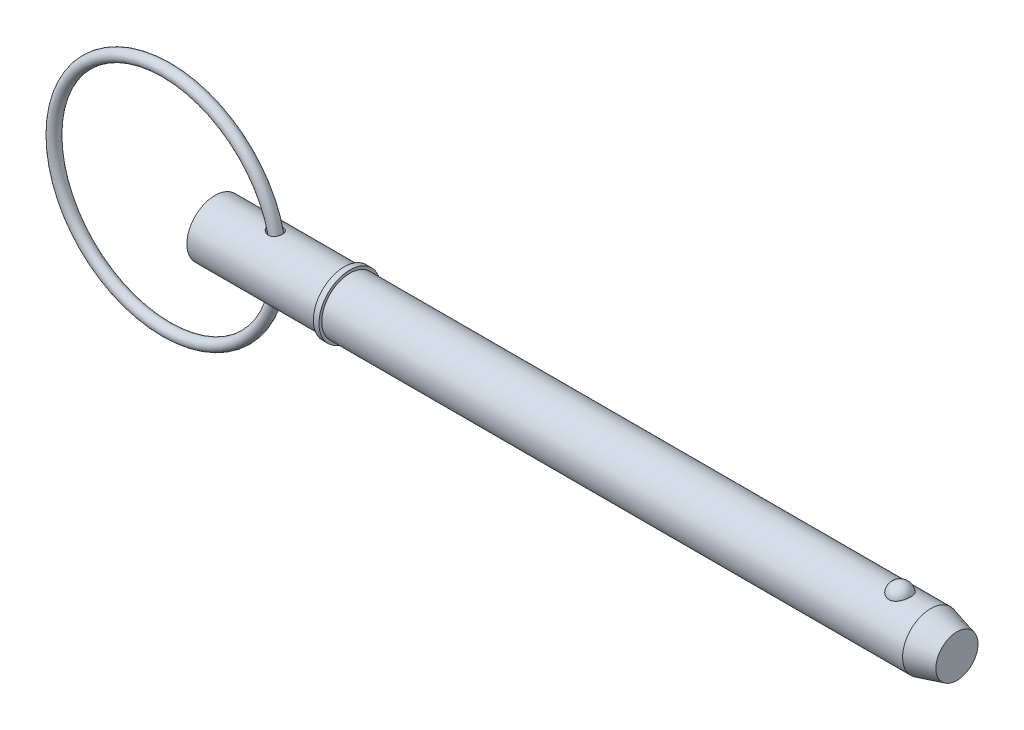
ISO-10303-21;
HEADER;
FILE_DESCRIPTION(('STEP AP214'),'2;1');
FILE_NAME('part.step','',(''),(''),'','','');
FILE_SCHEMA(('AUTOMOTIVE_DESIGN { 1 0 10303 214 1 1 1 1 }'));
ENDSEC;
DATA;
#1=APPLICATION_CONTEXT('core data for automotive mechanical design processes');
#2=APPLICATION_PROTOCOL_DEFINITION('international standard','automotive_design',2000,#1);
#3=PRODUCT_CONTEXT('',#1,'mechanical');
#4=PRODUCT('Part','Part','',(#3));
#5=PRODUCT_RELATED_PRODUCT_CATEGORY('part','',(#4));
#6=PRODUCT_DEFINITION_FORMATION('','',#4);
#7=PRODUCT_DEFINITION_CONTEXT('part definition',#1,'design');
#8=PRODUCT_DEFINITION('design','',#6,#7);
#9=PRODUCT_DEFINITION_SHAPE('','',#8);
#10=(LENGTH_UNIT() NAMED_UNIT(*) SI_UNIT(.MILLI.,.METRE.));
#11=(NAMED_UNIT(*) PLANE_ANGLE_UNIT() SI_UNIT($,.RADIAN.));
#12=(NAMED_UNIT(*) SI_UNIT($,.STERADIAN.) SOLID_ANGLE_UNIT());
#13=UNCERTAINTY_MEASURE_WITH_UNIT(LENGTH_MEASURE(1.E-05),#10,'distance_accuracy_value','');
#14=(GEOMETRIC_REPRESENTATION_CONTEXT(3) GLOBAL_UNCERTAINTY_ASSIGNED_CONTEXT((#13)) GLOBAL_UNIT_ASSIGNED_CONTEXT((#10,
#11,#12)) REPRESENTATION_CONTEXT('',''));
#15=CARTESIAN_POINT('',(0.,0.,0.));
#16=DIRECTION('',(0.,0.,1.));
#17=DIRECTION('',(1.,0.,0.));
#18=AXIS2_PLACEMENT_3D('',#15,#16,#17);
#19=CARTESIAN_POINT('',(-6.86864682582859,0.,0.));
#20=DIRECTION('',(0.,0.,1.));
#21=DIRECTION('',(1.,0.,0.));
#22=AXIS2_PLACEMENT_3D('',#19,#20,#21);
#23=TOROIDAL_SURFACE('',#22,15.875,0.794);
#24=CARTESIAN_POINT('',(9.80035317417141,0.,0.));
#25=VERTEX_POINT('',#24);
#26=VERTEX_LOOP('',#25);
#27=FACE_BOUND('',#26,.T.);
#28=ADVANCED_FACE('P0_F12',(#27),#23,.T.);
#29=CLOSED_SHELL('',(#28));
#30=MANIFOLD_SOLID_BREP('P0_B1',#29);
#31=CARTESIAN_POINT('',(0.,0.,0.));
#32=DIRECTION('',(1.,0.,0.));
#33=DIRECTION('',(0.,0.,-1.));
#34=AXIS2_PLACEMENT_3D('',#31,#32,#33);
#35=CYLINDRICAL_SURFACE('',#34,3.97);
#36=CARTESIAN_POINT('',(7.49679817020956,3.96502331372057,-0.198721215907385));
#37=CARTESIAN_POINT('',(7.50881508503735,3.96235594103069,-0.251916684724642));
#38=CARTESIAN_POINT('',(7.52561550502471,3.95866151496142,-0.304017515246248));
#39=CARTESIAN_POINT('',(7.56786984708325,3.9496659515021,-0.40447153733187));
#40=CARTESIAN_POINT('',(7.59333797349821,3.94436217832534,-0.452818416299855));
#41=CARTESIAN_POINT('',(7.65162192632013,3.93277091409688,-0.544364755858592));
#42=CARTESIAN_POINT('',(7.68440149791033,3.92648832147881,-0.587588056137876));
#43=CARTESIAN_POINT('',(7.75622109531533,3.91354812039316,-0.668369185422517));
#44=CARTESIAN_POINT('',(7.79526077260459,3.90689053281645,-0.705927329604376));
#45=CARTESIAN_POINT('',(7.88192852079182,3.8932854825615,-0.777603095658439));
#46=CARTESIAN_POINT('',(7.92999678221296,3.88635845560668,-0.811192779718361));
#47=CARTESIAN_POINT('',(8.03094744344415,3.87352417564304,-0.870420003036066));
#48=CARTESIAN_POINT('',(8.08383192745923,3.86761736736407,-0.896054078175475));
#49=CARTESIAN_POINT('',(8.19632733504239,3.85719062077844,-0.939958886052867));
#50=CARTESIAN_POINT('',(8.25615064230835,3.85277154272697,-0.957713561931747));
#51=CARTESIAN_POINT('',(8.37807849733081,3.84644428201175,-0.982821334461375));
#52=CARTESIAN_POINT('',(8.44018249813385,3.84453550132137,-0.990176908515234));
#53=CARTESIAN_POINT('',(8.56256649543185,3.84359535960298,-0.993820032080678));
#54=CARTESIAN_POINT('',(8.62283390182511,3.84446524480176,-0.990487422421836));
#55=CARTESIAN_POINT('',(8.74175397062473,3.84884648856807,-0.973323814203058));
#56=CARTESIAN_POINT('',(8.8004073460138,3.85235666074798,-0.959497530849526));
#57=CARTESIAN_POINT('',(8.91034168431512,3.86130428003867,-0.922798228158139));
#58=CARTESIAN_POINT('',(8.96185380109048,3.86659969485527,-0.900580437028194));
#59=CARTESIAN_POINT('',(9.06016940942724,3.87853590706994,-0.847697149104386));
#60=CARTESIAN_POINT('',(9.10697344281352,3.88517654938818,-0.817032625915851));
#61=CARTESIAN_POINT('',(9.19340982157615,3.89885483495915,-0.748999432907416));
#62=CARTESIAN_POINT('',(9.23319345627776,3.90587821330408,-0.711819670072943));
#63=CARTESIAN_POINT('',(9.30598310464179,3.91969783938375,-0.631295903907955));
#64=CARTESIAN_POINT('',(9.33898892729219,3.92649408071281,-0.587951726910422));
#65=CARTESIAN_POINT('',(9.39769437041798,3.939185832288,-0.495874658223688));
#66=CARTESIAN_POINT('',(9.42332322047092,3.94507238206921,-0.447095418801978));
#67=CARTESIAN_POINT('',(9.46625710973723,3.9552342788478,-0.345845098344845));
#68=CARTESIAN_POINT('',(9.48356178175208,3.95950955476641,-0.293373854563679));
#69=CARTESIAN_POINT('',(9.50956700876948,3.96602451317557,-0.185698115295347));
#70=CARTESIAN_POINT('',(9.51818595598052,3.96824487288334,-0.13047272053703));
#71=CARTESIAN_POINT('',(9.52633336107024,3.97034220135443,-0.0193113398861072));
#72=CARTESIAN_POINT('',(9.52586171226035,3.97021914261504,0.0366246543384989));
#73=CARTESIAN_POINT('',(9.51583327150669,3.9676413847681,0.147685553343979));
#74=CARTESIAN_POINT('',(9.50626624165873,3.96518405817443,0.202809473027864));
#75=CARTESIAN_POINT('',(9.47825604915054,3.95819854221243,0.310618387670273));
#76=CARTESIAN_POINT('',(9.45981267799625,3.95367030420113,0.36330332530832));
#77=CARTESIAN_POINT('',(9.41448405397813,3.94303435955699,0.464739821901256));
#78=CARTESIAN_POINT('',(9.38759833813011,3.93692656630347,0.51349116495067));
#79=CARTESIAN_POINT('',(9.32603556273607,3.92380455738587,0.605663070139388));
#80=CARTESIAN_POINT('',(9.29135869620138,3.91679036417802,0.649083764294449));
#81=CARTESIAN_POINT('',(9.21526329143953,3.90267522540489,0.729160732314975));
#82=CARTESIAN_POINT('',(9.17387556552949,3.89557480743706,0.765846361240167));
#83=CARTESIAN_POINT('',(9.08536362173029,3.88206315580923,0.831635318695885));
#84=CARTESIAN_POINT('',(9.03824022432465,3.8756518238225,0.860739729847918));
#85=CARTESIAN_POINT('',(8.94022154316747,3.86431915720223,0.910262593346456));
#86=CARTESIAN_POINT('',(8.88938101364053,3.85938013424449,0.930785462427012));
#87=CARTESIAN_POINT('',(8.78488780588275,3.85141510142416,0.96321476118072));
#88=CARTESIAN_POINT('',(8.73123520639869,3.84838903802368,0.975121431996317));
#89=CARTESIAN_POINT('',(8.62249427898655,3.84453017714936,0.990226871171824));
#90=CARTESIAN_POINT('',(8.56740225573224,3.84370373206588,0.993400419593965));
#91=CARTESIAN_POINT('',(8.45741104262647,3.8442816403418,0.991160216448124));
#92=CARTESIAN_POINT('',(8.40251189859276,3.84568649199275,0.98574454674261));
#93=CARTESIAN_POINT('',(8.29176880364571,3.85062289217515,0.966285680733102));
#94=CARTESIAN_POINT('',(8.23599684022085,3.85424894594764,0.951858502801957));
#95=CARTESIAN_POINT('',(8.12747212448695,3.86325492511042,0.91461785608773));
#96=CARTESIAN_POINT('',(8.0747205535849,3.86863553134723,0.891801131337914));
#97=CARTESIAN_POINT('',(7.97015235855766,3.88095261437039,0.836633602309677));
#98=CARTESIAN_POINT('',(7.91862083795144,3.88796764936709,0.803758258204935));
#99=CARTESIAN_POINT('',(7.82179253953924,3.90250904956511,0.729888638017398));
#100=CARTESIAN_POINT('',(7.77649765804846,3.91003556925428,0.688891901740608));
#101=CARTESIAN_POINT('',(7.69332536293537,3.92478114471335,0.599225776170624));
#102=CARTESIAN_POINT('',(7.6555122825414,3.93199714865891,0.550495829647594));
#103=CARTESIAN_POINT('',(7.5894819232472,3.94512912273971,0.446741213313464));
#104=CARTESIAN_POINT('',(7.56125849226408,3.95104592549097,0.391720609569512));
#105=CARTESIAN_POINT('',(7.51806227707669,3.9603062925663,0.282172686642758));
#106=CARTESIAN_POINT('',(7.50213211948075,3.96383230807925,0.228039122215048));
#107=CARTESIAN_POINT('',(7.48057398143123,3.96863642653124,0.117706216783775));
#108=CARTESIAN_POINT('',(7.47492746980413,3.96991857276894,0.0615107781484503));
#109=CARTESIAN_POINT('',(7.47437932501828,3.97004395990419,-0.0289758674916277));
#110=CARTESIAN_POINT('',(7.47615129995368,3.96964216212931,-0.0632805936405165));
#111=CARTESIAN_POINT('',(7.48358566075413,3.96796978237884,-0.131441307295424));
#112=CARTESIAN_POINT('',(7.48924767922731,3.96669928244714,-0.165297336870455));
#113=CARTESIAN_POINT('',(7.49679817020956,3.96502331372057,-0.198721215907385));
#114=B_SPLINE_CURVE_WITH_KNOTS('',3,(#36,#37,#38,#39,#40,#41,#42,#43,#44,#45,#46,#47,#48,#49,
#50,#51,#52,#53,#54,#55,#56,#57,#58,#59,#60,#61,#62,#63,#64,#65,#66,#67,#68,#69,#70,#71,#72,#73,
#74,#75,#76,#77,#78,#79,#80,#81,#82,#83,#84,#85,#86,#87,#88,#89,#90,#91,#92,#93,#94,#95,#96,#97,
#98,#99,#100,#101,#102,#103,#104,#105,#106,#107,#108,#109,#110,#111,#112,#113),.UNSPECIFIED.,
.T.,.F.,(4,2,2,2,2,2,2,2,2,2,2,2,2,2,2,2,2,2,2,2,2,2,2,2,2,2,2,2,2,2,2,2,2,2,2,2,2,2,4),(0.,
0.163661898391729,0.327593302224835,0.490729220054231,0.653856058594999,0.830244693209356,
1.00671002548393,1.1934572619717,1.38016000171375,1.56030212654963,1.74036335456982,
1.90857505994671,2.07676738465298,2.24071128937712,2.40465981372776,2.57013239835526,
2.73561228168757,2.90263284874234,3.06965537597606,3.23686612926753,3.40408081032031,
3.5713046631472,3.73852437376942,3.90499698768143,4.07144581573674,4.2358058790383,
4.40016134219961,4.56499094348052,4.72985735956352,4.90227873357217,5.0747670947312,
5.25849939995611,5.44228744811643,5.62759301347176,5.81277947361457,5.98144776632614,
6.14981181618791,6.25265388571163,6.35548624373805),.UNSPECIFIED.);
#115=CARTESIAN_POINT('',(7.49679817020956,3.96502331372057,-0.198721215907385));
#116=VERTEX_POINT('',#115);
#117=EDGE_CURVE('P1_E42',#116,#116,#114,.T.);
#118=ORIENTED_EDGE('',*,*,#117,.T.);
#119=EDGE_LOOP('',(#118));
#120=FACE_BOUND('',#119,.T.);
#121=CARTESIAN_POINT('',(0.,0.,0.));
#122=DIRECTION('',(1.,0.,0.));
#123=DIRECTION('',(0.,0.,-1.));
#124=AXIS2_PLACEMENT_3D('',#121,#122,#123);
#125=CIRCLE('',#124,3.97);
#126=CARTESIAN_POINT('',(0.,0.,-3.97));
#127=VERTEX_POINT('',#126);
#128=EDGE_CURVE('P1_E9',#127,#127,#125,.T.);
#129=ORIENTED_EDGE('',*,*,#128,.T.);
#130=EDGE_LOOP('',(#129));
#131=FACE_BOUND('',#130,.T.);
#132=CARTESIAN_POINT('',(18.256,0.,0.));
#133=DIRECTION('',(1.,0.,0.));
#134=DIRECTION('',(0.,0.,-1.));
#135=AXIS2_PLACEMENT_3D('',#132,#133,#134);
#136=CIRCLE('',#135,3.97);
#137=CARTESIAN_POINT('',(18.256,0.,-3.97));
#138=VERTEX_POINT('',#137);
#139=EDGE_CURVE('P1_E25',#138,#138,#136,.T.);
#140=ORIENTED_EDGE('',*,*,#139,.F.);
#141=EDGE_LOOP('',(#140));
#142=FACE_BOUND('',#141,.T.);
#143=CARTESIAN_POINT('',(7.49679817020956,-3.96502331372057,-0.198721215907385));
#144=CARTESIAN_POINT('',(7.48580986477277,-3.96746179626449,-0.150065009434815));
#145=CARTESIAN_POINT('',(7.47881617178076,-3.96904213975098,-0.100459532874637));
#146=CARTESIAN_POINT('',(7.47318383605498,-3.97031279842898,-0.000748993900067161));
#147=CARTESIAN_POINT('',(7.47454464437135,-3.97000323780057,0.049356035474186));
#148=CARTESIAN_POINT('',(7.48554252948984,-3.9675299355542,0.148550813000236));
#149=CARTESIAN_POINT('',(7.49517270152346,-3.9653677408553,0.197641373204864));
#150=CARTESIAN_POINT('',(7.5222068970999,-3.95942609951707,0.293523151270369));
#151=CARTESIAN_POINT('',(7.53961293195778,-3.9556462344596,0.340313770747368));
#152=CARTESIAN_POINT('',(7.58186218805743,-3.946757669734,0.431446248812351));
#153=CARTESIAN_POINT('',(7.6068526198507,-3.94162295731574,0.475716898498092));
#154=CARTESIAN_POINT('',(7.66318857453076,-3.93055115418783,0.559886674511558));
#155=CARTESIAN_POINT('',(7.69453617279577,-3.92461380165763,0.599784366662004));
#156=CARTESIAN_POINT('',(7.76618955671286,-3.91181958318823,0.678467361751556));
#157=CARTESIAN_POINT('',(7.80708710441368,-3.90493119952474,0.716708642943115));
#158=CARTESIAN_POINT('',(7.89431870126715,-3.89148185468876,0.786469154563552));
#159=CARTESIAN_POINT('',(7.94065563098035,-3.88492106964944,0.817984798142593));
#160=CARTESIAN_POINT('',(8.04208221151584,-3.87221514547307,0.876253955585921));
#161=CARTESIAN_POINT('',(8.09758465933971,-3.8661622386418,0.902312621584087));
#162=CARTESIAN_POINT('',(8.21228401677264,-3.855952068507,0.944996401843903));
#163=CARTESIAN_POINT('',(8.27148128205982,-3.85179498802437,0.961620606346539));
#164=CARTESIAN_POINT('',(8.39228716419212,-3.84593851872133,0.984786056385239));
#165=CARTESIAN_POINT('',(8.45390693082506,-3.84425231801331,0.991273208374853));
#166=CARTESIAN_POINT('',(8.57734686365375,-3.84370168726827,0.993408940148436));
#167=CARTESIAN_POINT('',(8.63916691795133,-3.84483588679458,0.989062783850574));
#168=CARTESIAN_POINT('',(8.75703619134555,-3.84970227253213,0.969937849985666));
#169=CARTESIAN_POINT('',(8.81320274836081,-3.85326512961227,0.955838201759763));
#170=CARTESIAN_POINT('',(8.92207486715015,-3.8624204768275,0.918140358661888));
#171=CARTESIAN_POINT('',(8.97478130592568,-3.86801245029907,0.89454458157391));
#172=CARTESIAN_POINT('',(9.07264210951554,-3.88024902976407,0.83982747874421));
#173=CARTESIAN_POINT('',(9.11803751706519,-3.88683023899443,0.809121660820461));
#174=CARTESIAN_POINT('',(9.20292513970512,-3.90048324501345,0.740506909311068));
#175=CARTESIAN_POINT('',(9.24241747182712,-3.90755503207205,0.702598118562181));
#176=CARTESIAN_POINT('',(9.31440361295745,-3.92139192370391,0.620727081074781));
#177=CARTESIAN_POINT('',(9.34691105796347,-3.9281576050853,0.576776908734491));
#178=CARTESIAN_POINT('',(9.40424150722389,-3.94066521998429,0.483990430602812));
#179=CARTESIAN_POINT('',(9.4290641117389,-3.94640710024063,0.435153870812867));
#180=CARTESIAN_POINT('',(9.47070060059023,-3.95631713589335,0.333318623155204));
#181=CARTESIAN_POINT('',(9.48741220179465,-3.96046506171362,0.280276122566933));
#182=CARTESIAN_POINT('',(9.51197570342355,-3.9666399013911,0.172058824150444));
#183=CARTESIAN_POINT('',(9.5198274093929,-3.96866676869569,0.116883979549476));
#184=CARTESIAN_POINT('',(9.52650209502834,-3.9703865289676,0.00572427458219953));
#185=CARTESIAN_POINT('',(9.52528754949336,-3.97006972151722,-0.0502629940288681));
#186=CARTESIAN_POINT('',(9.51376883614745,-3.96711300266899,-0.161232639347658));
#187=CARTESIAN_POINT('',(9.50346452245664,-3.96447305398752,-0.216214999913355));
#188=CARTESIAN_POINT('',(9.47400716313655,-3.95715440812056,-0.323616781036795));
#189=CARTESIAN_POINT('',(9.45485370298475,-3.95247561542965,-0.376036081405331));
#190=CARTESIAN_POINT('',(9.40815019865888,-3.94158766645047,-0.47682082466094));
#191=CARTESIAN_POINT('',(9.38060003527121,-3.93537848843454,-0.525186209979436));
#192=CARTESIAN_POINT('',(9.31780916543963,-3.92212278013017,-0.616423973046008));
#193=CARTESIAN_POINT('',(9.28257772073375,-3.91507726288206,-0.659302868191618));
#194=CARTESIAN_POINT('',(9.20530256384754,-3.90093459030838,-0.738394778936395));
#195=CARTESIAN_POINT('',(9.16325952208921,-3.8938374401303,-0.774608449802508));
#196=CARTESIAN_POINT('',(9.07394283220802,-3.88046830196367,-0.83901178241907));
#197=CARTESIAN_POINT('',(9.02672460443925,-3.87418889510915,-0.867276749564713));
#198=CARTESIAN_POINT('',(8.92806876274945,-3.86308015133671,-0.915492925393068));
#199=CARTESIAN_POINT('',(8.87663164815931,-3.85825064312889,-0.935445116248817));
#200=CARTESIAN_POINT('',(8.77150354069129,-3.85059630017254,-0.966469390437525));
#201=CARTESIAN_POINT('',(8.71783614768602,-3.84775433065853,-0.977617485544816));
#202=CARTESIAN_POINT('',(8.60934883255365,-3.84426767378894,-0.991239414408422));
#203=CARTESIAN_POINT('',(8.55452877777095,-3.84362324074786,-0.993712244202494));
#204=CARTESIAN_POINT('',(8.4438244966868,-3.84454392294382,-0.990144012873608));
#205=CARTESIAN_POINT('',(8.3879479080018,-3.84616465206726,-0.983888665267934));
#206=CARTESIAN_POINT('',(8.27791058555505,-3.85146784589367,-0.962917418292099));
#207=CARTESIAN_POINT('',(8.22375037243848,-3.85515092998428,-0.948198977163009));
#208=CARTESIAN_POINT('',(8.11503410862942,-3.86443542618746,-0.90964598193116));
#209=CARTESIAN_POINT('',(8.06067129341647,-3.87014379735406,-0.885291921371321));
#210=CARTESIAN_POINT('',(7.95661263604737,-3.88274545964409,-0.828274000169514));
#211=CARTESIAN_POINT('',(7.90691941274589,-3.88963940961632,-0.795605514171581));
#212=CARTESIAN_POINT('',(7.81143608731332,-3.90417480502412,-0.720990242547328));
#213=CARTESIAN_POINT('',(7.76592225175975,-3.9118359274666,-0.678692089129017));
#214=CARTESIAN_POINT('',(7.68309200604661,-3.926691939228,-0.586646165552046));
#215=CARTESIAN_POINT('',(7.6457689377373,-3.93388720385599,-0.536904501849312));
#216=CARTESIAN_POINT('',(7.58649683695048,-3.94577687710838,-0.440118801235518));
#217=CARTESIAN_POINT('',(7.56301593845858,-3.95068841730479,-0.394037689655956));
#218=CARTESIAN_POINT('',(7.52386335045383,-3.95904753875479,-0.298549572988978));
#219=CARTESIAN_POINT('',(7.5081856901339,-3.96249623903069,-0.249145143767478));
#220=CARTESIAN_POINT('',(7.49679817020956,-3.96502331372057,-0.198721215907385));
#221=B_SPLINE_CURVE_WITH_KNOTS('',3,(#143,#144,#145,#146,#147,#148,#149,#150,#151,#152,#153,
#154,#155,#156,#157,#158,#159,#160,#161,#162,#163,#164,#165,#166,#167,#168,#169,#170,#171,#172,
#173,#174,#175,#176,#177,#178,#179,#180,#181,#182,#183,#184,#185,#186,#187,#188,#189,#190,#191,
#192,#193,#194,#195,#196,#197,#198,#199,#200,#201,#202,#203,#204,#205,#206,#207,#208,#209,#210,
#211,#212,#213,#214,#215,#216,#217,#218,#219,#220),.UNSPECIFIED.,.T.,.F.,(4,2,2,2,2,2,2,2,2,2,2,
2,2,2,2,2,2,2,2,2,2,2,2,2,2,2,2,2,2,2,2,2,2,2,2,2,2,2,4),(0.,0.149644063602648,
0.299278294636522,0.448787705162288,0.598335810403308,0.750995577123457,0.903705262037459,
1.07224475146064,1.2408739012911,1.4248565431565,1.60885692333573,1.79383585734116,
1.97872492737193,2.15188813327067,2.32500727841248,2.489818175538,2.65462580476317,
2.81910871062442,2.98360017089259,3.15011526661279,3.31663401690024,3.48384236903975,
3.65105340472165,3.81827227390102,3.98549351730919,4.15251423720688,4.31951852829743,
4.48488279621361,4.65022752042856,4.81412860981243,4.97804866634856,5.14606470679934,
5.31413123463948,5.49286956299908,5.67170754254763,5.85859317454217,6.0453263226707,
6.20052601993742,6.35560677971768),.UNSPECIFIED.);
#222=CARTESIAN_POINT('',(7.49679817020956,-3.96502331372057,-0.198721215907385));
#223=VERTEX_POINT('',#222);
#224=EDGE_CURVE('P1_E17',#223,#223,#221,.T.);
#225=ORIENTED_EDGE('',*,*,#224,.T.);
#226=EDGE_LOOP('',(#225));
#227=FACE_BOUND('',#226,.T.);
#228=ADVANCED_FACE('P1_F13',(#120,#131,#142,#227),#35,.T.);
#229=CARTESIAN_POINT('',(0.,0.,0.));
#230=DIRECTION('',(1.,0.,0.));
#231=DIRECTION('',(0.,0.,-1.));
#232=AXIS2_PLACEMENT_3D('',#229,#230,#231);
#233=CYLINDRICAL_SURFACE('',#232,3.97);
#234=CARTESIAN_POINT('',(101.075939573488,0.,0.));
#235=DIRECTION('',(1.,0.,0.));
#236=DIRECTION('',(0.,0.,-1.));
#237=AXIS2_PLACEMENT_3D('',#234,#235,#236);
#238=CIRCLE('',#237,3.97);
#239=CARTESIAN_POINT('',(101.075939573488,0.,-3.97));
#240=VERTEX_POINT('',#239);
#241=EDGE_CURVE('P1_E99',#240,#240,#238,.T.);
#242=ORIENTED_EDGE('',*,*,#241,.F.);
#243=EDGE_LOOP('',(#242));
#244=FACE_BOUND('',#243,.T.);
#245=CARTESIAN_POINT('',(19.05,0.,0.));
#246=DIRECTION('',(1.,0.,0.));
#247=DIRECTION('',(0.,0.,-1.));
#248=AXIS2_PLACEMENT_3D('',#245,#246,#247);
#249=CIRCLE('',#248,3.97);
#250=CARTESIAN_POINT('',(19.05,0.,-3.97));
#251=VERTEX_POINT('',#250);
#252=EDGE_CURVE('P1_E96',#251,#251,#249,.T.);
#253=ORIENTED_EDGE('',*,*,#252,.T.);
#254=EDGE_LOOP('',(#253));
#255=FACE_BOUND('',#254,.T.);
#256=CARTESIAN_POINT('',(96.7451922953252,3.65715365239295,1.5447094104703));
#257=CARTESIAN_POINT('',(96.6652448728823,3.65716001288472,1.54470290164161));
#258=CARTESIAN_POINT('',(96.5851650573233,3.65987074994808,1.53832549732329));
#259=CARTESIAN_POINT('',(96.4272374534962,3.6704221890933,1.51297018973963));
#260=CARTESIAN_POINT('',(96.3493961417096,3.67827646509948,1.49395894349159));
#261=CARTESIAN_POINT('',(96.1984614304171,3.69818848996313,1.4439595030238));
#262=CARTESIAN_POINT('',(96.1253560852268,3.71023513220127,1.41300293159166));
#263=CARTESIAN_POINT('',(95.9855630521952,3.7372183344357,1.34000212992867));
#264=CARTESIAN_POINT('',(95.9188725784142,3.75215363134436,1.29796274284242));
#265=CARTESIAN_POINT('',(95.7914886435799,3.78384968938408,1.20248834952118));
#266=CARTESIAN_POINT('',(95.7310299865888,3.80065129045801,1.14875388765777));
#267=CARTESIAN_POINT('',(95.6196942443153,3.83398532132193,1.03205417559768));
#268=CARTESIAN_POINT('',(95.5688200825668,3.85051766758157,0.969086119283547));
#269=CARTESIAN_POINT('',(95.4756321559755,3.88238608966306,0.832526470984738));
#270=CARTESIAN_POINT('',(95.4337961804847,3.89763698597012,0.758588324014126));
#271=CARTESIAN_POINT('',(95.3625108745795,3.92451063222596,0.604352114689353));
#272=CARTESIAN_POINT('',(95.3330623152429,3.93613315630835,0.524053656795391));
#273=CARTESIAN_POINT('',(95.2868927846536,3.95467606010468,0.358403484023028));
#274=CARTESIAN_POINT('',(95.2703127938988,3.96154426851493,0.273006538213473));
#275=CARTESIAN_POINT('',(95.250756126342,3.96967008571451,0.100408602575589));
#276=CARTESIAN_POINT('',(95.2477789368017,3.97092790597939,0.0132076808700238));
#277=CARTESIAN_POINT('',(95.2554587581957,3.96771794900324,-0.159844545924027));
#278=CARTESIAN_POINT('',(95.2660164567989,3.96329187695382,-0.245701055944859));
#279=CARTESIAN_POINT('',(95.30038009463,3.94923163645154,-0.414277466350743));
#280=CARTESIAN_POINT('',(95.3241862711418,3.93959737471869,-0.496997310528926));
#281=CARTESIAN_POINT('',(95.3846114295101,3.91607752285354,-0.657113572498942));
#282=CARTESIAN_POINT('',(95.4212495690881,3.90218558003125,-0.73450182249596));
#283=CARTESIAN_POINT('',(95.5065935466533,3.87158287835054,-0.881704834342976));
#284=CARTESIAN_POINT('',(95.5553004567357,3.8548718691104,-0.951518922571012));
#285=CARTESIAN_POINT('',(95.6641161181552,3.82028735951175,-1.08208159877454));
#286=CARTESIAN_POINT('',(95.7242955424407,3.80240713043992,-1.14276958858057));
#287=CARTESIAN_POINT('',(95.854493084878,3.76758161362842,-1.2528243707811));
#288=CARTESIAN_POINT('',(95.9245105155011,3.75063626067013,-1.30219195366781));
#289=CARTESIAN_POINT('',(96.07118160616,3.71998948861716,-1.38729709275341));
#290=CARTESIAN_POINT('',(96.1476813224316,3.70623183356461,-1.42327904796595));
#291=CARTESIAN_POINT('',(96.3062981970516,3.68323188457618,-1.48178996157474));
#292=CARTESIAN_POINT('',(96.3884132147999,3.67398788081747,-1.50432401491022));
#293=CARTESIAN_POINT('',(96.5514810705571,3.6615216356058,-1.53440939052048));
#294=CARTESIAN_POINT('',(96.6322840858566,3.65801951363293,-1.54265826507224));
#295=CARTESIAN_POINT('',(96.7942085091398,3.65657341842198,-1.54608423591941));
#296=CARTESIAN_POINT('',(96.8753298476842,3.65862829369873,-1.5412640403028));
#297=CARTESIAN_POINT('',(97.0328122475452,3.66788969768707,-1.51908474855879));
#298=CARTESIAN_POINT('',(97.1092422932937,3.67492621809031,-1.50213925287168));
#299=CARTESIAN_POINT('',(97.2580412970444,3.69318404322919,-1.4566698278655));
#300=CARTESIAN_POINT('',(97.3304099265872,3.7044056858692,-1.42814496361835));
#301=CARTESIAN_POINT('',(97.4708029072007,3.73012749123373,-1.35956319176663));
#302=CARTESIAN_POINT('',(97.5387000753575,3.74469307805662,-1.31927107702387));
#303=CARTESIAN_POINT('',(97.6668649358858,3.77545272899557,-1.22847440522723));
#304=CARTESIAN_POINT('',(97.7271308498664,3.79164717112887,-1.17796747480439));
#305=CARTESIAN_POINT('',(97.8416346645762,3.82490325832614,-1.0651926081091));
#306=CARTESIAN_POINT('',(97.8954137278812,3.84196735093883,-1.0024591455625));
#307=CARTESIAN_POINT('',(97.9920988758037,3.87439863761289,-0.868715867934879));
#308=CARTESIAN_POINT('',(98.0350030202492,3.88976552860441,-0.797704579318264));
#309=CARTESIAN_POINT('',(98.110266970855,3.91771381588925,-0.646896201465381));
#310=CARTESIAN_POINT('',(98.1422532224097,3.93019255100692,-0.566893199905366));
#311=CARTESIAN_POINT('',(98.1931101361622,3.95043886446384,-0.402255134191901));
#312=CARTESIAN_POINT('',(98.2119807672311,3.95820643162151,-0.317620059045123));
#313=CARTESIAN_POINT('',(98.2362162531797,3.96823733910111,-0.146156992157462));
#314=CARTESIAN_POINT('',(98.2415874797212,3.97050327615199,-0.0593300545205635));
#315=CARTESIAN_POINT('',(98.2387309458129,3.96930811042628,0.114057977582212));
#316=CARTESIAN_POINT('',(98.2305035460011,3.9658471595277,0.200619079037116));
#317=CARTESIAN_POINT('',(98.2007063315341,3.95358562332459,0.37050665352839));
#318=CARTESIAN_POINT('',(98.1792129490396,3.94481563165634,0.453848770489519));
#319=CARTESIAN_POINT('',(98.1233839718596,3.92284586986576,0.615497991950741));
#320=CARTESIAN_POINT('',(98.0890474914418,3.90964579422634,0.693804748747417));
#321=CARTESIAN_POINT('',(98.0079702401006,3.88006987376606,0.843703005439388));
#322=CARTESIAN_POINT('',(97.9611536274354,3.86367478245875,0.915249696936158));
#323=CARTESIAN_POINT('',(97.8561897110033,3.82949741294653,1.04910810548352));
#324=CARTESIAN_POINT('',(97.7980428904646,3.81171519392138,1.1114202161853));
#325=CARTESIAN_POINT('',(97.6717433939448,3.77673366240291,1.22503948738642));
#326=CARTESIAN_POINT('',(97.6035970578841,3.75953398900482,1.27635357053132));
#327=CARTESIAN_POINT('',(97.4589009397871,3.72770506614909,1.36653336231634));
#328=CARTESIAN_POINT('',(97.382348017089,3.7130767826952,1.40539439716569));
#329=CARTESIAN_POINT('',(97.2257594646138,3.68864287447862,1.46830480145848));
#330=CARTESIAN_POINT('',(97.1459307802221,3.67869017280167,1.49281289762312));
#331=CARTESIAN_POINT('',(96.9829877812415,3.66414535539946,1.52817474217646));
#332=CARTESIAN_POINT('',(96.8998840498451,3.65953723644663,1.53906926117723));
#333=CARTESIAN_POINT('',(96.7927760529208,3.6573894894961,1.54414878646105));
#334=CARTESIAN_POINT('',(96.7689900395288,3.65715175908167,1.54471134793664));
#335=CARTESIAN_POINT('',(96.7451922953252,3.65715365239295,1.5447094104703));
#336=B_SPLINE_CURVE_WITH_KNOTS('',3,(#256,#257,#258,#259,#260,#261,#262,#263,#264,#265,#266,
#267,#268,#269,#270,#271,#272,#273,#274,#275,#276,#277,#278,#279,#280,#281,#282,#283,#284,#285,
#286,#287,#288,#289,#290,#291,#292,#293,#294,#295,#296,#297,#298,#299,#300,#301,#302,#303,#304,
#305,#306,#307,#308,#309,#310,#311,#312,#313,#314,#315,#316,#317,#318,#319,#320,#321,#322,#323,
#324,#325,#326,#327,#328,#329,#330,#331,#332,#333,#334,#335),.UNSPECIFIED.,.T.,.F.,(4,2,2,2,2,2,
2,2,2,2,2,2,2,2,2,2,2,2,2,2,2,2,2,2,2,2,2,2,2,2,2,2,2,2,2,2,2,2,2,4),(0.,0.239777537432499,
0.480190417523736,0.719971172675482,0.9596473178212,1.20639040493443,1.45320863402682,
1.71093679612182,1.9686809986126,2.22921052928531,2.48973023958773,2.74834928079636,
3.00697295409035,3.26598440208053,3.52501886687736,3.78570385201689,4.04637062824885,
4.30201257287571,4.55755760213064,4.80022994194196,5.04285200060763,5.27757006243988,
5.51230707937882,5.75210128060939,5.99195126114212,6.2439281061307,6.49594987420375,
6.75588818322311,7.01582710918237,7.27564332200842,7.53545264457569,7.79377886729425,
8.05212290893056,8.31207418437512,8.57201437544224,8.83179046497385,9.09166393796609,
9.34270057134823,9.59298357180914,9.66435753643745),.UNSPECIFIED.);
#337=CARTESIAN_POINT('',(96.7451922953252,3.65715365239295,1.5447094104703));
#338=VERTEX_POINT('',#337);
#339=EDGE_CURVE('P1_E34',#338,#338,#336,.T.);
#340=ORIENTED_EDGE('',*,*,#339,.T.);
#341=EDGE_LOOP('',(#340));
#342=FACE_BOUND('',#341,.T.);
#343=ADVANCED_FACE('P1_F46',(#244,#255,#342),#233,.T.);
#344=CARTESIAN_POINT('',(0.,0.,0.));
#345=DIRECTION('',(-1.,0.,0.));
#346=DIRECTION('',(0.,0.,1.));
#347=AXIS2_PLACEMENT_3D('',#344,#345,#346);
#348=PLANE('',#347);
#349=ORIENTED_EDGE('',*,*,#128,.F.);
#350=EDGE_LOOP('',(#349));
#351=FACE_BOUND('',#350,.T.);
#352=ADVANCED_FACE('P1_F15',(#351),#348,.T.);
#353=CARTESIAN_POINT('',(18.256,3.97,0.));
#354=DIRECTION('',(-1.,0.,0.));
#355=DIRECTION('',(0.,0.,1.));
#356=AXIS2_PLACEMENT_3D('',#353,#354,#355);
#357=PLANE('',#356);
#358=ORIENTED_EDGE('',*,*,#139,.T.);
#359=EDGE_LOOP('',(#358));
#360=FACE_BOUND('',#359,.T.);
#361=CARTESIAN_POINT('',(18.256,0.,0.));
#362=DIRECTION('',(1.,0.,0.));
#363=DIRECTION('',(0.,0.,-1.));
#364=AXIS2_PLACEMENT_3D('',#361,#362,#363);
#365=CIRCLE('',#364,4.367);
#366=CARTESIAN_POINT('',(18.256,0.,-4.367));
#367=VERTEX_POINT('',#366);
#368=EDGE_CURVE('P1_E30',#367,#367,#365,.T.);
#369=ORIENTED_EDGE('',*,*,#368,.F.);
#370=EDGE_LOOP('',(#369));
#371=FACE_BOUND('',#370,.T.);
#372=ADVANCED_FACE('P1_F81',(#360,#371),#357,.T.);
#373=CARTESIAN_POINT('',(0.,0.,0.));
#374=DIRECTION('',(1.,0.,0.));
#375=DIRECTION('',(0.,0.,-1.));
#376=AXIS2_PLACEMENT_3D('',#373,#374,#375);
#377=CYLINDRICAL_SURFACE('',#376,4.367);
#378=ORIENTED_EDGE('',*,*,#368,.T.);
#379=EDGE_LOOP('',(#378));
#380=FACE_BOUND('',#379,.T.);
#381=CARTESIAN_POINT('',(19.05,0.,0.));
#382=DIRECTION('',(1.,0.,0.));
#383=DIRECTION('',(0.,0.,-1.));
#384=AXIS2_PLACEMENT_3D('',#381,#382,#383);
#385=CIRCLE('',#384,4.367);
#386=CARTESIAN_POINT('',(19.05,0.,-4.367));
#387=VERTEX_POINT('',#386);
#388=EDGE_CURVE('P1_E95',#387,#387,#385,.T.);
#389=ORIENTED_EDGE('',*,*,#388,.F.);
#390=EDGE_LOOP('',(#389));
#391=FACE_BOUND('',#390,.T.);
#392=ADVANCED_FACE('P1_F68',(#380,#391),#377,.T.);
#393=CARTESIAN_POINT('',(19.05,4.367,0.));
#394=DIRECTION('',(1.,0.,0.));
#395=DIRECTION('',(0.,0.,-1.));
#396=AXIS2_PLACEMENT_3D('',#393,#394,#395);
#397=PLANE('',#396);
#398=ORIENTED_EDGE('',*,*,#388,.T.);
#399=EDGE_LOOP('',(#398));
#400=FACE_BOUND('',#399,.T.);
#401=ORIENTED_EDGE('',*,*,#252,.F.);
#402=EDGE_LOOP('',(#401));
#403=FACE_BOUND('',#402,.T.);
#404=ADVANCED_FACE('P1_F62',(#400,#403),#397,.T.);
#405=CARTESIAN_POINT('',(104.78,0.,0.));
#406=DIRECTION('',(-1.,0.,0.));
#407=DIRECTION('',(0.,0.,1.));
#408=AXIS2_PLACEMENT_3D('',#405,#406,#407);
#409=CONICAL_SURFACE('',#408,2.97750000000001,0.261799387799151);
#410=ORIENTED_EDGE('',*,*,#241,.T.);
#411=EDGE_LOOP('',(#410));
#412=FACE_BOUND('',#411,.T.);
#413=CARTESIAN_POINT('',(104.78,0.,0.));
#414=DIRECTION('',(1.,0.,0.));
#415=DIRECTION('',(0.,0.,-1.));
#416=AXIS2_PLACEMENT_3D('',#413,#414,#415);
#417=CIRCLE('',#416,2.97750000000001);
#418=CARTESIAN_POINT('',(104.78,0.,-2.97750000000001));
#419=VERTEX_POINT('',#418);
#420=EDGE_CURVE('P1_E41',#419,#419,#417,.T.);
#421=ORIENTED_EDGE('',*,*,#420,.F.);
#422=EDGE_LOOP('',(#421));
#423=FACE_BOUND('',#422,.T.);
#424=ADVANCED_FACE('P1_F59',(#412,#423),#409,.T.);
#425=CARTESIAN_POINT('',(104.78,2.97750000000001,0.));
#426=DIRECTION('',(1.,0.,0.));
#427=DIRECTION('',(0.,0.,-1.));
#428=AXIS2_PLACEMENT_3D('',#425,#426,#427);
#429=PLANE('',#428);
#430=ORIENTED_EDGE('',*,*,#420,.T.);
#431=EDGE_LOOP('',(#430));
#432=FACE_BOUND('',#431,.T.);
#433=ADVANCED_FACE('P1_F55',(#432),#429,.T.);
#434=CARTESIAN_POINT('',(96.7451922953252,3.57299999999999,0.));
#435=DIRECTION('',(-1.,0.,0.));
#436=DIRECTION('',(0.,1.,0.));
#437=AXIS2_PLACEMENT_3D('',#434,#435,#436);
#438=SPHERICAL_SURFACE('',#437,1.54700000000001);
#439=ORIENTED_EDGE('',*,*,#339,.F.);
#440=EDGE_LOOP('',(#439));
#441=FACE_BOUND('',#440,.T.);
#442=ADVANCED_FACE('P1_F50',(#441),#438,.T.);
#443=CARTESIAN_POINT('',(-6.86864682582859,0.,0.));
#444=DIRECTION('',(0.,0.,1.));
#445=DIRECTION('',(1.,0.,0.));
#446=AXIS2_PLACEMENT_3D('',#443,#444,#445);
#447=TOROIDAL_SURFACE('',#446,15.875,0.992500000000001);
#448=ORIENTED_EDGE('',*,*,#224,.F.);
#449=EDGE_LOOP('',(#448));
#450=FACE_BOUND('',#449,.T.);
#451=ORIENTED_EDGE('',*,*,#117,.F.);
#452=EDGE_LOOP('',(#451));
#453=FACE_BOUND('',#452,.T.);
#454=ADVANCED_FACE('P1_F54',(#450,#453),#447,.F.);
#455=CLOSED_SHELL('',(#228,#343,#352,#372,#392,#404,#424,#433,#442,#454));
#456=MANIFOLD_SOLID_BREP('P1_B1',#455);
#457=ADVANCED_BREP_SHAPE_REPRESENTATION('',(#18,#30,#456),#14);
#458=SHAPE_DEFINITION_REPRESENTATION(#9,#457);
ENDSEC;
END-ISO-10303-21;
